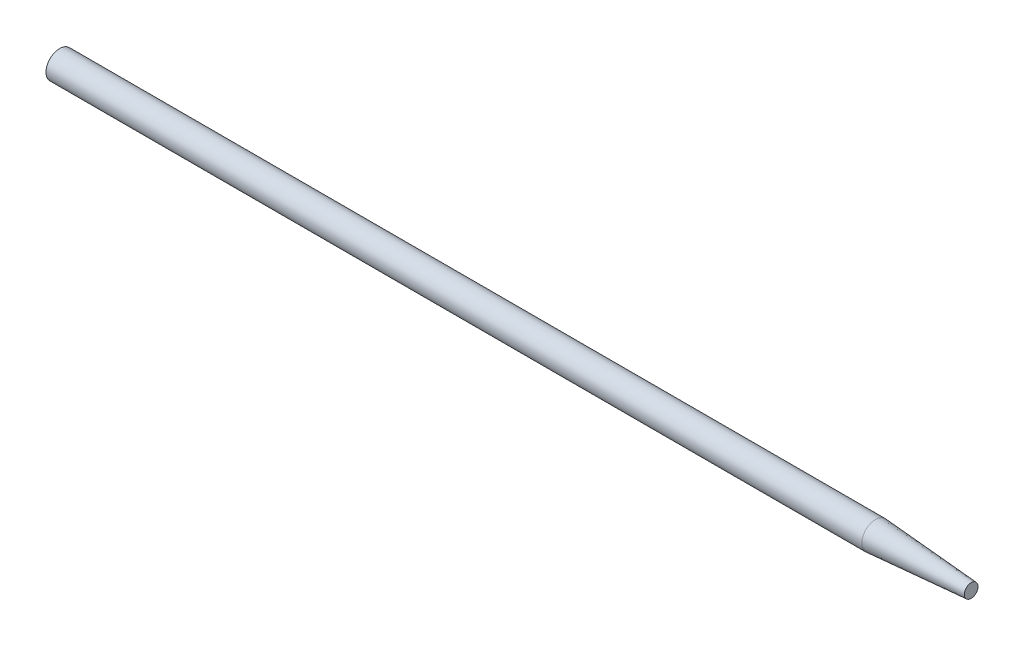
from build123d import *


with BuildPart() as part:
    # izim1 → D_nd_r1 (revolve)
    with BuildSketch(Plane.XY, mode=Mode.PRIVATE) as d_nd_r1_sk:
        Polygon((500, 3.75), (447.506701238, 7.5), (0, 7.5), (0, 0), (500, 0), align=None)
    revolve(d_nd_r1_sk.sketch.rotate(Axis((0, 0, 0), (1, 0, 0)), 90), axis=Axis((0, 0, 0), (1, 0, 0)))


solid = part.part
